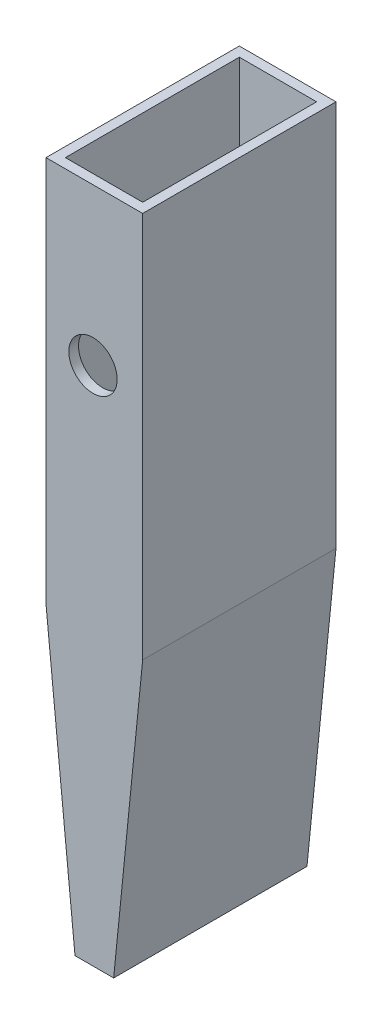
ISO-10303-21;
HEADER;
FILE_DESCRIPTION(('STEP AP214'),'2;1');
FILE_NAME('part.step','',(''),(''),'','','');
FILE_SCHEMA(('AUTOMOTIVE_DESIGN { 1 0 10303 214 1 1 1 1 }'));
ENDSEC;
DATA;
#1=APPLICATION_CONTEXT('core data for automotive mechanical design processes');
#2=APPLICATION_PROTOCOL_DEFINITION('international standard','automotive_design',2000,#1);
#3=PRODUCT_CONTEXT('',#1,'mechanical');
#4=PRODUCT('Part','Part','',(#3));
#5=PRODUCT_RELATED_PRODUCT_CATEGORY('part','',(#4));
#6=PRODUCT_DEFINITION_FORMATION('','',#4);
#7=PRODUCT_DEFINITION_CONTEXT('part definition',#1,'design');
#8=PRODUCT_DEFINITION('design','',#6,#7);
#9=PRODUCT_DEFINITION_SHAPE('','',#8);
#10=(LENGTH_UNIT() NAMED_UNIT(*) SI_UNIT(.MILLI.,.METRE.));
#11=(NAMED_UNIT(*) PLANE_ANGLE_UNIT() SI_UNIT($,.RADIAN.));
#12=(NAMED_UNIT(*) SI_UNIT($,.STERADIAN.) SOLID_ANGLE_UNIT());
#13=UNCERTAINTY_MEASURE_WITH_UNIT(LENGTH_MEASURE(1.E-05),#10,'distance_accuracy_value','');
#14=(GEOMETRIC_REPRESENTATION_CONTEXT(3) GLOBAL_UNCERTAINTY_ASSIGNED_CONTEXT((#13)) GLOBAL_UNIT_ASSIGNED_CONTEXT((#10,
#11,#12)) REPRESENTATION_CONTEXT('',''));
#15=CARTESIAN_POINT('',(0.,0.,0.));
#16=DIRECTION('',(0.,0.,1.));
#17=DIRECTION('',(1.,0.,0.));
#18=AXIS2_PLACEMENT_3D('',#15,#16,#17);
#19=CARTESIAN_POINT('',(-5.,20.,20.));
#20=DIRECTION('',(0.,-1.,0.));
#21=DIRECTION('',(1.,0.,0.));
#22=AXIS2_PLACEMENT_3D('',#19,#20,#21);
#23=PLANE('',#22);
#24=DIRECTION('',(-1.,0.,0.));
#25=VECTOR('',#24,1.);
#26=CARTESIAN_POINT('',(-5.,20.,0.));
#27=LINE('',#26,#25);
#28=CARTESIAN_POINT('',(5.,20.,0.));
#29=VERTEX_POINT('',#28);
#30=CARTESIAN_POINT('',(-5.,20.,0.));
#31=VERTEX_POINT('',#30);
#32=EDGE_CURVE('E202',#29,#31,#27,.T.);
#33=ORIENTED_EDGE('',*,*,#32,.T.);
#34=DIRECTION('',(0.,0.,-1.));
#35=VECTOR('',#34,1.);
#36=CARTESIAN_POINT('',(-5.,20.,20.));
#37=LINE('',#36,#35);
#38=CARTESIAN_POINT('',(-5.,20.,20.));
#39=VERTEX_POINT('',#38);
#40=EDGE_CURVE('E217',#39,#31,#37,.T.);
#41=ORIENTED_EDGE('',*,*,#40,.F.);
#42=DIRECTION('',(-1.,0.,0.));
#43=VECTOR('',#42,1.);
#44=CARTESIAN_POINT('',(-5.,20.,20.));
#45=LINE('',#44,#43);
#46=CARTESIAN_POINT('',(5.,20.,20.));
#47=VERTEX_POINT('',#46);
#48=EDGE_CURVE('E189',#47,#39,#45,.T.);
#49=ORIENTED_EDGE('',*,*,#48,.F.);
#50=DIRECTION('',(0.,0.,-1.));
#51=VECTOR('',#50,1.);
#52=CARTESIAN_POINT('',(5.,20.,20.));
#53=LINE('',#52,#51);
#54=EDGE_CURVE('E44',#47,#29,#53,.T.);
#55=ORIENTED_EDGE('',*,*,#54,.T.);
#56=EDGE_LOOP('',(#33,#41,#49,#55));
#57=FACE_BOUND('',#56,.T.);
#58=DIRECTION('',(-1.,0.,0.));
#59=VECTOR('',#58,1.);
#60=CARTESIAN_POINT('',(-5.,20.,1.));
#61=LINE('',#60,#59);
#62=CARTESIAN_POINT('',(4.,20.,1.));
#63=VERTEX_POINT('',#62);
#64=CARTESIAN_POINT('',(-4.,20.,1.));
#65=VERTEX_POINT('',#64);
#66=EDGE_CURVE('E136',#63,#65,#61,.T.);
#67=ORIENTED_EDGE('',*,*,#66,.F.);
#68=DIRECTION('',(0.,0.,-1.));
#69=VECTOR('',#68,1.);
#70=CARTESIAN_POINT('',(4.,20.,20.));
#71=LINE('',#70,#69);
#72=CARTESIAN_POINT('',(4.,20.,19.));
#73=VERTEX_POINT('',#72);
#74=EDGE_CURVE('E132',#73,#63,#71,.T.);
#75=ORIENTED_EDGE('',*,*,#74,.F.);
#76=DIRECTION('',(-1.,0.,0.));
#77=VECTOR('',#76,1.);
#78=CARTESIAN_POINT('',(-5.,20.,19.));
#79=LINE('',#78,#77);
#80=CARTESIAN_POINT('',(-4.,20.,19.));
#81=VERTEX_POINT('',#80);
#82=EDGE_CURVE('E51',#73,#81,#79,.T.);
#83=ORIENTED_EDGE('',*,*,#82,.T.);
#84=DIRECTION('',(0.,0.,-1.));
#85=VECTOR('',#84,1.);
#86=CARTESIAN_POINT('',(-4.,20.,20.));
#87=LINE('',#86,#85);
#88=EDGE_CURVE('E169',#81,#65,#87,.T.);
#89=ORIENTED_EDGE('',*,*,#88,.T.);
#90=EDGE_LOOP('',(#67,#75,#83,#89));
#91=FACE_BOUND('',#90,.T.);
#92=ADVANCED_FACE('F35',(#57,#91),#23,.F.);
#93=CARTESIAN_POINT('',(-1.99999999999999,-50.,20.));
#94=DIRECTION('',(0.,1.,0.));
#95=DIRECTION('',(0.,0.,1.));
#96=AXIS2_PLACEMENT_3D('',#93,#94,#95);
#97=PLANE('',#96);
#98=DIRECTION('',(1.,0.,0.));
#99=VECTOR('',#98,1.);
#100=CARTESIAN_POINT('',(-1.99999999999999,-50.,0.));
#101=LINE('',#100,#99);
#102=CARTESIAN_POINT('',(-1.99999999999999,-50.,0.));
#103=VERTEX_POINT('',#102);
#104=CARTESIAN_POINT('',(2.00000000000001,-50.,0.));
#105=VERTEX_POINT('',#104);
#106=EDGE_CURVE('E187',#103,#105,#101,.T.);
#107=ORIENTED_EDGE('',*,*,#106,.T.);
#108=DIRECTION('',(0.,0.,-1.));
#109=VECTOR('',#108,1.);
#110=CARTESIAN_POINT('',(2.00000000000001,-50.,20.));
#111=LINE('',#110,#109);
#112=CARTESIAN_POINT('',(2.00000000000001,-50.,20.));
#113=VERTEX_POINT('',#112);
#114=EDGE_CURVE('E197',#113,#105,#111,.T.);
#115=ORIENTED_EDGE('',*,*,#114,.F.);
#116=DIRECTION('',(1.,0.,0.));
#117=VECTOR('',#116,1.);
#118=CARTESIAN_POINT('',(-1.99999999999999,-50.,20.));
#119=LINE('',#118,#117);
#120=CARTESIAN_POINT('',(-1.99999999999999,-50.,20.));
#121=VERTEX_POINT('',#120);
#122=EDGE_CURVE('E195',#121,#113,#119,.T.);
#123=ORIENTED_EDGE('',*,*,#122,.F.);
#124=DIRECTION('',(0.,0.,-1.));
#125=VECTOR('',#124,1.);
#126=CARTESIAN_POINT('',(-1.99999999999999,-50.,20.));
#127=LINE('',#126,#125);
#128=EDGE_CURVE('E211',#121,#103,#127,.T.);
#129=ORIENTED_EDGE('',*,*,#128,.T.);
#130=EDGE_LOOP('',(#107,#115,#123,#129));
#131=FACE_BOUND('',#130,.T.);
#132=DIRECTION('',(1.,0.,0.));
#133=VECTOR('',#132,1.);
#134=CARTESIAN_POINT('',(-1.99999999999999,-50.,1.));
#135=LINE('',#134,#133);
#136=CARTESIAN_POINT('',(-0.995012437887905,-50.,1.));
#137=VERTEX_POINT('',#136);
#138=CARTESIAN_POINT('',(0.995012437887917,-50.,1.));
#139=VERTEX_POINT('',#138);
#140=EDGE_CURVE('E149',#137,#139,#135,.T.);
#141=ORIENTED_EDGE('',*,*,#140,.F.);
#142=DIRECTION('',(0.,0.,-1.));
#143=VECTOR('',#142,1.);
#144=CARTESIAN_POINT('',(-0.995012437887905,-50.,20.));
#145=LINE('',#144,#143);
#146=CARTESIAN_POINT('',(-0.995012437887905,-50.,19.));
#147=VERTEX_POINT('',#146);
#148=EDGE_CURVE('E170',#147,#137,#145,.T.);
#149=ORIENTED_EDGE('',*,*,#148,.F.);
#150=DIRECTION('',(1.,0.,0.));
#151=VECTOR('',#150,1.);
#152=CARTESIAN_POINT('',(-1.99999999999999,-50.,19.));
#153=LINE('',#152,#151);
#154=CARTESIAN_POINT('',(0.995012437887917,-50.,19.));
#155=VERTEX_POINT('',#154);
#156=EDGE_CURVE('E58',#147,#155,#153,.T.);
#157=ORIENTED_EDGE('',*,*,#156,.T.);
#158=DIRECTION('',(0.,0.,-1.));
#159=VECTOR('',#158,1.);
#160=CARTESIAN_POINT('',(0.995012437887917,-50.,20.));
#161=LINE('',#160,#159);
#162=EDGE_CURVE('E172',#155,#139,#161,.T.);
#163=ORIENTED_EDGE('',*,*,#162,.T.);
#164=EDGE_LOOP('',(#141,#149,#157,#163));
#165=FACE_BOUND('',#164,.T.);
#166=ADVANCED_FACE('F251',(#131,#165),#97,.F.);
#167=CARTESIAN_POINT('',(5.00000000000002,-20.,20.));
#168=DIRECTION('',(-0.995037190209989,0.0995037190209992,0.));
#169=DIRECTION('',(-0.0995037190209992,-0.995037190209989,0.));
#170=AXIS2_PLACEMENT_3D('',#167,#168,#169);
#171=PLANE('',#170);
#172=DIRECTION('',(0.0995037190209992,0.995037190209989,0.));
#173=VECTOR('',#172,1.);
#174=CARTESIAN_POINT('',(5.00000000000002,-20.,0.));
#175=LINE('',#174,#173);
#176=CARTESIAN_POINT('',(5.00000000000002,-20.,0.));
#177=VERTEX_POINT('',#176);
#178=EDGE_CURVE('E145',#105,#177,#175,.T.);
#179=ORIENTED_EDGE('',*,*,#178,.T.);
#180=DIRECTION('',(0.,0.,-1.));
#181=VECTOR('',#180,1.);
#182=CARTESIAN_POINT('',(5.00000000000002,-20.,20.));
#183=LINE('',#182,#181);
#184=CARTESIAN_POINT('',(5.00000000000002,-20.,20.));
#185=VERTEX_POINT('',#184);
#186=EDGE_CURVE('E11',#185,#177,#183,.T.);
#187=ORIENTED_EDGE('',*,*,#186,.F.);
#188=DIRECTION('',(0.0995037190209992,0.995037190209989,0.));
#189=VECTOR('',#188,1.);
#190=CARTESIAN_POINT('',(5.00000000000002,-20.,20.));
#191=LINE('',#190,#189);
#192=EDGE_CURVE('E183',#113,#185,#191,.T.);
#193=ORIENTED_EDGE('',*,*,#192,.F.);
#194=ORIENTED_EDGE('',*,*,#114,.T.);
#195=EDGE_LOOP('',(#179,#187,#193,#194));
#196=FACE_BOUND('',#195,.T.);
#197=ADVANCED_FACE('F37',(#196),#171,.F.);
#198=CARTESIAN_POINT('',(5.,20.,20.));
#199=DIRECTION('',(-1.,0.,0.));
#200=DIRECTION('',(0.,-1.,0.));
#201=AXIS2_PLACEMENT_3D('',#198,#199,#200);
#202=PLANE('',#201);
#203=DIRECTION('',(0.,1.,0.));
#204=VECTOR('',#203,1.);
#205=CARTESIAN_POINT('',(5.,20.,0.));
#206=LINE('',#205,#204);
#207=EDGE_CURVE('E200',#177,#29,#206,.T.);
#208=ORIENTED_EDGE('',*,*,#207,.T.);
#209=ORIENTED_EDGE('',*,*,#54,.F.);
#210=DIRECTION('',(0.,1.,0.));
#211=VECTOR('',#210,1.);
#212=CARTESIAN_POINT('',(5.,20.,20.));
#213=LINE('',#212,#211);
#214=EDGE_CURVE('E186',#185,#47,#213,.T.);
#215=ORIENTED_EDGE('',*,*,#214,.F.);
#216=ORIENTED_EDGE('',*,*,#186,.T.);
#217=EDGE_LOOP('',(#208,#209,#215,#216));
#218=FACE_BOUND('',#217,.T.);
#219=ADVANCED_FACE('F248',(#218),#202,.F.);
#220=CARTESIAN_POINT('',(-5.,20.,20.));
#221=DIRECTION('',(1.,0.,0.));
#222=DIRECTION('',(0.,1.,0.));
#223=AXIS2_PLACEMENT_3D('',#220,#221,#222);
#224=PLANE('',#223);
#225=DIRECTION('',(0.,-1.,0.));
#226=VECTOR('',#225,1.);
#227=CARTESIAN_POINT('',(-5.,20.,0.));
#228=LINE('',#227,#226);
#229=CARTESIAN_POINT('',(-5.00000000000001,-20.,0.));
#230=VERTEX_POINT('',#229);
#231=EDGE_CURVE('E204',#31,#230,#228,.T.);
#232=ORIENTED_EDGE('',*,*,#231,.T.);
#233=DIRECTION('',(0.,0.,-1.));
#234=VECTOR('',#233,1.);
#235=CARTESIAN_POINT('',(-5.00000000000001,-20.,20.));
#236=LINE('',#235,#234);
#237=CARTESIAN_POINT('',(-5.00000000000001,-20.,20.));
#238=VERTEX_POINT('',#237);
#239=EDGE_CURVE('E214',#238,#230,#236,.T.);
#240=ORIENTED_EDGE('',*,*,#239,.F.);
#241=DIRECTION('',(0.,-1.,0.));
#242=VECTOR('',#241,1.);
#243=CARTESIAN_POINT('',(-5.,20.,20.));
#244=LINE('',#243,#242);
#245=EDGE_CURVE('E191',#39,#238,#244,.T.);
#246=ORIENTED_EDGE('',*,*,#245,.F.);
#247=ORIENTED_EDGE('',*,*,#40,.T.);
#248=EDGE_LOOP('',(#232,#240,#246,#247));
#249=FACE_BOUND('',#248,.T.);
#250=ADVANCED_FACE('F236',(#249),#224,.F.);
#251=CARTESIAN_POINT('',(-5.00000000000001,-20.,20.));
#252=DIRECTION('',(0.995037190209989,0.0995037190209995,0.));
#253=DIRECTION('',(-0.0995037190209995,0.995037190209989,0.));
#254=AXIS2_PLACEMENT_3D('',#251,#252,#253);
#255=PLANE('',#254);
#256=DIRECTION('',(0.0995037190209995,-0.995037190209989,0.));
#257=VECTOR('',#256,1.);
#258=CARTESIAN_POINT('',(-5.00000000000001,-20.,0.));
#259=LINE('',#258,#257);
#260=EDGE_CURVE('E206',#230,#103,#259,.T.);
#261=ORIENTED_EDGE('',*,*,#260,.T.);
#262=ORIENTED_EDGE('',*,*,#128,.F.);
#263=DIRECTION('',(0.0995037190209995,-0.995037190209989,0.));
#264=VECTOR('',#263,1.);
#265=CARTESIAN_POINT('',(-5.00000000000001,-20.,20.));
#266=LINE('',#265,#264);
#267=EDGE_CURVE('E193',#238,#121,#266,.T.);
#268=ORIENTED_EDGE('',*,*,#267,.F.);
#269=ORIENTED_EDGE('',*,*,#239,.T.);
#270=EDGE_LOOP('',(#261,#262,#268,#269));
#271=FACE_BOUND('',#270,.T.);
#272=ADVANCED_FACE('F240',(#271),#255,.F.);
#273=CARTESIAN_POINT('',(0.,0.,20.));
#274=DIRECTION('',(0.,0.,1.));
#275=DIRECTION('',(1.,0.,0.));
#276=AXIS2_PLACEMENT_3D('',#273,#274,#275);
#277=PLANE('',#276);
#278=CARTESIAN_POINT('',(-0.138164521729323,3.80992905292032,20.));
#279=DIRECTION('',(0.,0.,1.));
#280=DIRECTION('',(1.,0.,0.));
#281=AXIS2_PLACEMENT_3D('',#278,#279,#280);
#282=CIRCLE('',#281,2.5);
#283=CARTESIAN_POINT('',(2.36183547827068,3.80992905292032,20.));
#284=VERTEX_POINT('',#283);
#285=EDGE_CURVE('E380',#284,#284,#282,.T.);
#286=ORIENTED_EDGE('',*,*,#285,.F.);
#287=EDGE_LOOP('',(#286));
#288=FACE_BOUND('',#287,.T.);
#289=ORIENTED_EDGE('',*,*,#192,.T.);
#290=ORIENTED_EDGE('',*,*,#214,.T.);
#291=ORIENTED_EDGE('',*,*,#48,.T.);
#292=ORIENTED_EDGE('',*,*,#245,.T.);
#293=ORIENTED_EDGE('',*,*,#267,.T.);
#294=ORIENTED_EDGE('',*,*,#122,.T.);
#295=EDGE_LOOP('',(#289,#290,#291,#292,#293,#294));
#296=FACE_BOUND('',#295,.T.);
#297=ADVANCED_FACE('F244',(#288,#296),#277,.T.);
#298=CARTESIAN_POINT('',(0.,0.,0.));
#299=DIRECTION('',(0.,0.,1.));
#300=DIRECTION('',(1.,0.,0.));
#301=AXIS2_PLACEMENT_3D('',#298,#299,#300);
#302=PLANE('',#301);
#303=CARTESIAN_POINT('',(-0.138164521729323,3.80992905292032,0.));
#304=DIRECTION('',(0.,0.,1.));
#305=DIRECTION('',(1.,0.,0.));
#306=AXIS2_PLACEMENT_3D('',#303,#304,#305);
#307=CIRCLE('',#306,2.5);
#308=CARTESIAN_POINT('',(2.36183547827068,3.80992905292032,0.));
#309=VERTEX_POINT('',#308);
#310=EDGE_CURVE('E382',#309,#309,#307,.T.);
#311=ORIENTED_EDGE('',*,*,#310,.T.);
#312=EDGE_LOOP('',(#311));
#313=FACE_BOUND('',#312,.T.);
#314=ORIENTED_EDGE('',*,*,#178,.F.);
#315=ORIENTED_EDGE('',*,*,#106,.F.);
#316=ORIENTED_EDGE('',*,*,#260,.F.);
#317=ORIENTED_EDGE('',*,*,#231,.F.);
#318=ORIENTED_EDGE('',*,*,#32,.F.);
#319=ORIENTED_EDGE('',*,*,#207,.F.);
#320=EDGE_LOOP('',(#314,#315,#316,#317,#318,#319));
#321=FACE_BOUND('',#320,.T.);
#322=ADVANCED_FACE('F231',(#313,#321),#302,.F.);
#323=CARTESIAN_POINT('',(4.00496280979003,-19.900496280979,20.));
#324=DIRECTION('',(-0.995037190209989,0.0995037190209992,0.));
#325=DIRECTION('',(-0.0995037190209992,-0.995037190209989,0.));
#326=AXIS2_PLACEMENT_3D('',#323,#324,#325);
#327=PLANE('',#326);
#328=DIRECTION('',(0.0995037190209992,0.995037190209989,0.));
#329=VECTOR('',#328,1.);
#330=CARTESIAN_POINT('',(4.00496280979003,-19.900496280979,1.));
#331=LINE('',#330,#329);
#332=CARTESIAN_POINT('',(4.00000000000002,-19.9501243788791,1.));
#333=VERTEX_POINT('',#332);
#334=EDGE_CURVE('E137',#139,#333,#331,.T.);
#335=ORIENTED_EDGE('',*,*,#334,.F.);
#336=ORIENTED_EDGE('',*,*,#162,.F.);
#337=DIRECTION('',(0.0995037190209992,0.995037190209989,0.));
#338=VECTOR('',#337,1.);
#339=CARTESIAN_POINT('',(4.00496280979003,-19.900496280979,19.));
#340=LINE('',#339,#338);
#341=CARTESIAN_POINT('',(4.00000000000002,-19.9501243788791,19.));
#342=VERTEX_POINT('',#341);
#343=EDGE_CURVE('E144',#155,#342,#340,.T.);
#344=ORIENTED_EDGE('',*,*,#343,.T.);
#345=DIRECTION('',(0.,0.,-1.));
#346=VECTOR('',#345,1.);
#347=CARTESIAN_POINT('',(4.00000000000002,-19.9501243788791,20.));
#348=LINE('',#347,#346);
#349=EDGE_CURVE('E130',#342,#333,#348,.T.);
#350=ORIENTED_EDGE('',*,*,#349,.T.);
#351=EDGE_LOOP('',(#335,#336,#344,#350));
#352=FACE_BOUND('',#351,.T.);
#353=ADVANCED_FACE('F142',(#352),#327,.T.);
#354=CARTESIAN_POINT('',(4.,20.,20.));
#355=DIRECTION('',(-1.,0.,0.));
#356=DIRECTION('',(0.,-1.,0.));
#357=AXIS2_PLACEMENT_3D('',#354,#355,#356);
#358=PLANE('',#357);
#359=DIRECTION('',(0.,1.,0.));
#360=VECTOR('',#359,1.);
#361=CARTESIAN_POINT('',(4.,20.,1.));
#362=LINE('',#361,#360);
#363=EDGE_CURVE('E127',#333,#63,#362,.T.);
#364=ORIENTED_EDGE('',*,*,#363,.F.);
#365=ORIENTED_EDGE('',*,*,#349,.F.);
#366=DIRECTION('',(0.,1.,0.));
#367=VECTOR('',#366,1.);
#368=CARTESIAN_POINT('',(4.,20.,19.));
#369=LINE('',#368,#367);
#370=EDGE_CURVE('E156',#342,#73,#369,.T.);
#371=ORIENTED_EDGE('',*,*,#370,.T.);
#372=ORIENTED_EDGE('',*,*,#74,.T.);
#373=EDGE_LOOP('',(#364,#365,#371,#372));
#374=FACE_BOUND('',#373,.T.);
#375=ADVANCED_FACE('F129',(#374),#358,.T.);
#376=CARTESIAN_POINT('',(-4.,20.,20.));
#377=DIRECTION('',(1.,0.,0.));
#378=DIRECTION('',(0.,1.,0.));
#379=AXIS2_PLACEMENT_3D('',#376,#377,#378);
#380=PLANE('',#379);
#381=DIRECTION('',(0.,-1.,0.));
#382=VECTOR('',#381,1.);
#383=CARTESIAN_POINT('',(-4.,20.,1.));
#384=LINE('',#383,#382);
#385=CARTESIAN_POINT('',(-4.00000000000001,-19.9501243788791,1.));
#386=VERTEX_POINT('',#385);
#387=EDGE_CURVE('E163',#65,#386,#384,.T.);
#388=ORIENTED_EDGE('',*,*,#387,.F.);
#389=ORIENTED_EDGE('',*,*,#88,.F.);
#390=DIRECTION('',(0.,-1.,0.));
#391=VECTOR('',#390,1.);
#392=CARTESIAN_POINT('',(-4.,20.,19.));
#393=LINE('',#392,#391);
#394=CARTESIAN_POINT('',(-4.00000000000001,-19.9501243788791,19.));
#395=VERTEX_POINT('',#394);
#396=EDGE_CURVE('E159',#81,#395,#393,.T.);
#397=ORIENTED_EDGE('',*,*,#396,.T.);
#398=DIRECTION('',(0.,0.,-1.));
#399=VECTOR('',#398,1.);
#400=CARTESIAN_POINT('',(-4.00000000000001,-19.9501243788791,20.));
#401=LINE('',#400,#399);
#402=EDGE_CURVE('E166',#395,#386,#401,.T.);
#403=ORIENTED_EDGE('',*,*,#402,.T.);
#404=EDGE_LOOP('',(#388,#389,#397,#403));
#405=FACE_BOUND('',#404,.T.);
#406=ADVANCED_FACE('F259',(#405),#380,.T.);
#407=CARTESIAN_POINT('',(-4.00496280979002,-19.900496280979,20.));
#408=DIRECTION('',(0.995037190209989,0.0995037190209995,0.));
#409=DIRECTION('',(-0.0995037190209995,0.995037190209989,0.));
#410=AXIS2_PLACEMENT_3D('',#407,#408,#409);
#411=PLANE('',#410);
#412=DIRECTION('',(0.0995037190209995,-0.995037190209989,0.));
#413=VECTOR('',#412,1.);
#414=CARTESIAN_POINT('',(-4.00496280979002,-19.900496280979,1.));
#415=LINE('',#414,#413);
#416=EDGE_CURVE('E165',#386,#137,#415,.T.);
#417=ORIENTED_EDGE('',*,*,#416,.F.);
#418=ORIENTED_EDGE('',*,*,#402,.F.);
#419=DIRECTION('',(0.0995037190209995,-0.995037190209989,0.));
#420=VECTOR('',#419,1.);
#421=CARTESIAN_POINT('',(-4.00496280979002,-19.900496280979,19.));
#422=LINE('',#421,#420);
#423=EDGE_CURVE('E161',#395,#147,#422,.T.);
#424=ORIENTED_EDGE('',*,*,#423,.T.);
#425=ORIENTED_EDGE('',*,*,#148,.T.);
#426=EDGE_LOOP('',(#417,#418,#424,#425));
#427=FACE_BOUND('',#426,.T.);
#428=ADVANCED_FACE('F263',(#427),#411,.T.);
#429=CARTESIAN_POINT('',(0.,0.,19.));
#430=DIRECTION('',(0.,0.,1.));
#431=DIRECTION('',(1.,0.,0.));
#432=AXIS2_PLACEMENT_3D('',#429,#430,#431);
#433=PLANE('',#432);
#434=CARTESIAN_POINT('',(-0.138164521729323,3.80992905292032,19.));
#435=DIRECTION('',(0.,0.,1.));
#436=DIRECTION('',(1.,0.,0.));
#437=AXIS2_PLACEMENT_3D('',#434,#435,#436);
#438=CIRCLE('',#437,2.5);
#439=CARTESIAN_POINT('',(2.36183547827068,3.80992905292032,19.));
#440=VERTEX_POINT('',#439);
#441=EDGE_CURVE('E150',#440,#440,#438,.T.);
#442=ORIENTED_EDGE('',*,*,#441,.T.);
#443=EDGE_LOOP('',(#442));
#444=FACE_BOUND('',#443,.T.);
#445=ORIENTED_EDGE('',*,*,#343,.F.);
#446=ORIENTED_EDGE('',*,*,#156,.F.);
#447=ORIENTED_EDGE('',*,*,#423,.F.);
#448=ORIENTED_EDGE('',*,*,#396,.F.);
#449=ORIENTED_EDGE('',*,*,#82,.F.);
#450=ORIENTED_EDGE('',*,*,#370,.F.);
#451=EDGE_LOOP('',(#445,#446,#447,#448,#449,#450));
#452=FACE_BOUND('',#451,.T.);
#453=ADVANCED_FACE('F256',(#444,#452),#433,.F.);
#454=CARTESIAN_POINT('',(0.,0.,1.));
#455=DIRECTION('',(0.,0.,1.));
#456=DIRECTION('',(1.,0.,0.));
#457=AXIS2_PLACEMENT_3D('',#454,#455,#456);
#458=PLANE('',#457);
#459=CARTESIAN_POINT('',(-0.138164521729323,3.80992905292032,1.));
#460=DIRECTION('',(0.,0.,1.));
#461=DIRECTION('',(1.,0.,0.));
#462=AXIS2_PLACEMENT_3D('',#459,#460,#461);
#463=CIRCLE('',#462,2.5);
#464=CARTESIAN_POINT('',(2.36183547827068,3.80992905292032,1.));
#465=VERTEX_POINT('',#464);
#466=EDGE_CURVE('E39',#465,#465,#463,.T.);
#467=ORIENTED_EDGE('',*,*,#466,.F.);
#468=EDGE_LOOP('',(#467));
#469=FACE_BOUND('',#468,.T.);
#470=ORIENTED_EDGE('',*,*,#334,.T.);
#471=ORIENTED_EDGE('',*,*,#363,.T.);
#472=ORIENTED_EDGE('',*,*,#66,.T.);
#473=ORIENTED_EDGE('',*,*,#387,.T.);
#474=ORIENTED_EDGE('',*,*,#416,.T.);
#475=ORIENTED_EDGE('',*,*,#140,.T.);
#476=EDGE_LOOP('',(#470,#471,#472,#473,#474,#475));
#477=FACE_BOUND('',#476,.T.);
#478=ADVANCED_FACE('F147',(#469,#477),#458,.T.);
#479=CARTESIAN_POINT('',(-0.138164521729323,3.80992905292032,0.));
#480=DIRECTION('',(0.,0.,1.));
#481=DIRECTION('',(1.,0.,0.));
#482=AXIS2_PLACEMENT_3D('',#479,#480,#481);
#483=CYLINDRICAL_SURFACE('',#482,2.5);
#484=ORIENTED_EDGE('',*,*,#466,.T.);
#485=EDGE_LOOP('',(#484));
#486=FACE_BOUND('',#485,.T.);
#487=ORIENTED_EDGE('',*,*,#310,.F.);
#488=EDGE_LOOP('',(#487));
#489=FACE_BOUND('',#488,.T.);
#490=ADVANCED_FACE('F354',(#486,#489),#483,.F.);
#491=ORIENTED_EDGE('',*,*,#285,.T.);
#492=EDGE_LOOP('',(#491));
#493=FACE_BOUND('',#492,.T.);
#494=ORIENTED_EDGE('',*,*,#441,.F.);
#495=EDGE_LOOP('',(#494));
#496=FACE_BOUND('',#495,.T.);
#497=ADVANCED_FACE('F364',(#493,#496),#483,.F.);
#498=CLOSED_SHELL('',(#92,#166,#197,#219,#250,#272,#297,#322,#353,#375,#406,#428,#453,#478,#490,#497));
#499=MANIFOLD_SOLID_BREP('B2',#498);
#500=ADVANCED_BREP_SHAPE_REPRESENTATION('',(#18,#499),#14);
#501=SHAPE_DEFINITION_REPRESENTATION(#9,#500);
ENDSEC;
END-ISO-10303-21;
